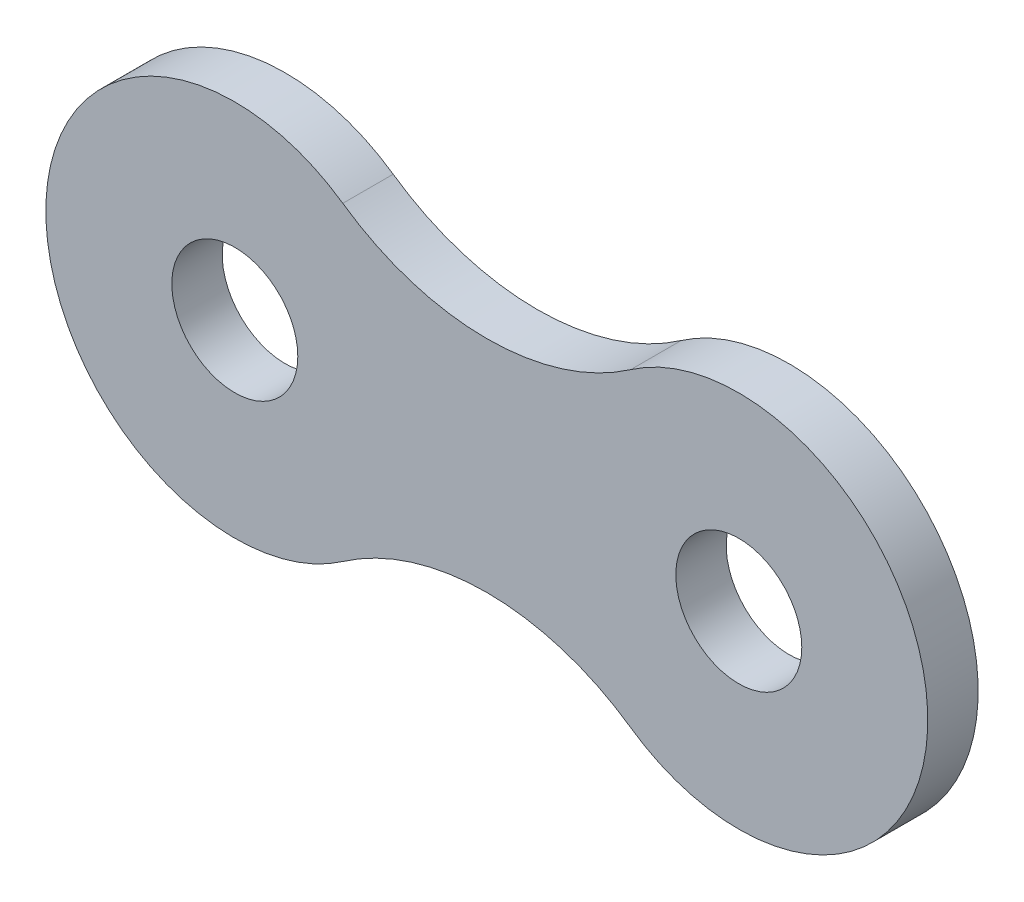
ISO-10303-21;
HEADER;
FILE_DESCRIPTION(('STEP AP214'),'2;1');
FILE_NAME('part.step','',(''),(''),'','','');
FILE_SCHEMA(('AUTOMOTIVE_DESIGN { 1 0 10303 214 1 1 1 1 }'));
ENDSEC;
DATA;
#1=APPLICATION_CONTEXT('core data for automotive mechanical design processes');
#2=APPLICATION_PROTOCOL_DEFINITION('international standard','automotive_design',2000,#1);
#3=PRODUCT_CONTEXT('',#1,'mechanical');
#4=PRODUCT('Part','Part','',(#3));
#5=PRODUCT_RELATED_PRODUCT_CATEGORY('part','',(#4));
#6=PRODUCT_DEFINITION_FORMATION('','',#4);
#7=PRODUCT_DEFINITION_CONTEXT('part definition',#1,'design');
#8=PRODUCT_DEFINITION('design','',#6,#7);
#9=PRODUCT_DEFINITION_SHAPE('','',#8);
#10=(LENGTH_UNIT() NAMED_UNIT(*) SI_UNIT(.MILLI.,.METRE.));
#11=(NAMED_UNIT(*) PLANE_ANGLE_UNIT() SI_UNIT($,.RADIAN.));
#12=(NAMED_UNIT(*) SI_UNIT($,.STERADIAN.) SOLID_ANGLE_UNIT());
#13=UNCERTAINTY_MEASURE_WITH_UNIT(LENGTH_MEASURE(1.E-05),#10,'distance_accuracy_value','');
#14=(GEOMETRIC_REPRESENTATION_CONTEXT(3) GLOBAL_UNCERTAINTY_ASSIGNED_CONTEXT((#13)) GLOBAL_UNIT_ASSIGNED_CONTEXT((#10,
#11,#12)) REPRESENTATION_CONTEXT('',''));
#15=CARTESIAN_POINT('',(0.,0.,0.));
#16=DIRECTION('',(0.,0.,1.));
#17=DIRECTION('',(1.,0.,0.));
#18=AXIS2_PLACEMENT_3D('',#15,#16,#17);
#19=CARTESIAN_POINT('',(5.,7.18070330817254,2.));
#20=DIRECTION('',(0.,0.,-1.));
#21=DIRECTION('',(-1.,0.,0.));
#22=AXIS2_PLACEMENT_3D('',#19,#20,#21);
#23=PLANE('',#22);
#24=CARTESIAN_POINT('',(0.,0.,2.));
#25=DIRECTION('',(0.,0.,1.));
#26=DIRECTION('',(1.,0.,0.));
#27=AXIS2_PLACEMENT_3D('',#24,#25,#26);
#28=CIRCLE('',#27,2.5);
#29=CARTESIAN_POINT('',(2.5,0.,2.));
#30=VERTEX_POINT('',#29);
#31=EDGE_CURVE('E100',#30,#30,#28,.T.);
#32=ORIENTED_EDGE('',*,*,#31,.F.);
#33=EDGE_LOOP('',(#32));
#34=FACE_BOUND('',#33,.T.);
#35=CARTESIAN_POINT('',(10.,14.3614066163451,2.));
#36=DIRECTION('',(0.,0.,-1.));
#37=DIRECTION('',(-1.,0.,0.));
#38=AXIS2_PLACEMENT_3D('',#35,#36,#37);
#39=CIRCLE('',#38,10.);
#40=CARTESIAN_POINT('',(15.7142857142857,6.15488854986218,2.));
#41=VERTEX_POINT('',#40);
#42=CARTESIAN_POINT('',(4.28571428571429,6.15488854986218,2.));
#43=VERTEX_POINT('',#42);
#44=EDGE_CURVE('E85',#41,#43,#39,.T.);
#45=ORIENTED_EDGE('',*,*,#44,.T.);
#46=CARTESIAN_POINT('',(0.,0.,2.));
#47=DIRECTION('',(0.,0.,1.));
#48=DIRECTION('',(1.,0.,0.));
#49=AXIS2_PLACEMENT_3D('',#46,#47,#48);
#50=CIRCLE('',#49,7.5);
#51=CARTESIAN_POINT('',(4.28571428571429,-6.15488854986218,2.));
#52=VERTEX_POINT('',#51);
#53=EDGE_CURVE('E80',#43,#52,#50,.T.);
#54=ORIENTED_EDGE('',*,*,#53,.T.);
#55=CARTESIAN_POINT('',(10.,-14.3614066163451,2.));
#56=DIRECTION('',(0.,0.,-1.));
#57=DIRECTION('',(1.,0.,0.));
#58=AXIS2_PLACEMENT_3D('',#55,#56,#57);
#59=CIRCLE('',#58,10.);
#60=CARTESIAN_POINT('',(15.7142857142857,-6.15488854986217,2.));
#61=VERTEX_POINT('',#60);
#62=EDGE_CURVE('E83',#52,#61,#59,.T.);
#63=ORIENTED_EDGE('',*,*,#62,.T.);
#64=CARTESIAN_POINT('',(20.,0.,2.));
#65=DIRECTION('',(0.,0.,1.));
#66=DIRECTION('',(1.,0.,0.));
#67=AXIS2_PLACEMENT_3D('',#64,#65,#66);
#68=CIRCLE('',#67,7.5);
#69=EDGE_CURVE('E50',#61,#41,#68,.T.);
#70=ORIENTED_EDGE('',*,*,#69,.T.);
#71=EDGE_LOOP('',(#45,#54,#63,#70));
#72=FACE_BOUND('',#71,.T.);
#73=CARTESIAN_POINT('',(20.,0.,2.));
#74=DIRECTION('',(0.,0.,1.));
#75=DIRECTION('',(1.,0.,0.));
#76=AXIS2_PLACEMENT_3D('',#73,#74,#75);
#77=CIRCLE('',#76,2.5);
#78=CARTESIAN_POINT('',(22.5,0.,2.));
#79=VERTEX_POINT('',#78);
#80=EDGE_CURVE('E115',#79,#79,#77,.T.);
#81=ORIENTED_EDGE('',*,*,#80,.F.);
#82=EDGE_LOOP('',(#81));
#83=FACE_BOUND('',#82,.T.);
#84=ADVANCED_FACE('F33',(#34,#72,#83),#23,.F.);
#85=CARTESIAN_POINT('',(5.,7.18070330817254,0.));
#86=DIRECTION('',(0.,0.,-1.));
#87=DIRECTION('',(-1.,0.,0.));
#88=AXIS2_PLACEMENT_3D('',#85,#86,#87);
#89=PLANE('',#88);
#90=CARTESIAN_POINT('',(0.,0.,0.));
#91=DIRECTION('',(0.,0.,1.));
#92=DIRECTION('',(1.,0.,0.));
#93=AXIS2_PLACEMENT_3D('',#90,#91,#92);
#94=CIRCLE('',#93,2.5);
#95=CARTESIAN_POINT('',(2.5,0.,0.));
#96=VERTEX_POINT('',#95);
#97=EDGE_CURVE('E112',#96,#96,#94,.T.);
#98=ORIENTED_EDGE('',*,*,#97,.T.);
#99=EDGE_LOOP('',(#98));
#100=FACE_BOUND('',#99,.T.);
#101=CARTESIAN_POINT('',(10.,14.3614066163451,0.));
#102=DIRECTION('',(0.,0.,-1.));
#103=DIRECTION('',(-1.,0.,0.));
#104=AXIS2_PLACEMENT_3D('',#101,#102,#103);
#105=CIRCLE('',#104,10.);
#106=CARTESIAN_POINT('',(15.7142857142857,6.15488854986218,0.));
#107=VERTEX_POINT('',#106);
#108=CARTESIAN_POINT('',(4.28571428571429,6.15488854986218,0.));
#109=VERTEX_POINT('',#108);
#110=EDGE_CURVE('E97',#107,#109,#105,.T.);
#111=ORIENTED_EDGE('',*,*,#110,.F.);
#112=CARTESIAN_POINT('',(20.,0.,0.));
#113=DIRECTION('',(0.,0.,1.));
#114=DIRECTION('',(1.,0.,0.));
#115=AXIS2_PLACEMENT_3D('',#112,#113,#114);
#116=CIRCLE('',#115,7.5);
#117=CARTESIAN_POINT('',(15.7142857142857,-6.15488854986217,0.));
#118=VERTEX_POINT('',#117);
#119=EDGE_CURVE('E73',#118,#107,#116,.T.);
#120=ORIENTED_EDGE('',*,*,#119,.F.);
#121=CARTESIAN_POINT('',(10.,-14.3614066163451,0.));
#122=DIRECTION('',(0.,0.,-1.));
#123=DIRECTION('',(1.,0.,0.));
#124=AXIS2_PLACEMENT_3D('',#121,#122,#123);
#125=CIRCLE('',#124,10.);
#126=CARTESIAN_POINT('',(4.28571428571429,-6.15488854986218,0.));
#127=VERTEX_POINT('',#126);
#128=EDGE_CURVE('E67',#127,#118,#125,.T.);
#129=ORIENTED_EDGE('',*,*,#128,.F.);
#130=CARTESIAN_POINT('',(0.,0.,0.));
#131=DIRECTION('',(0.,0.,1.));
#132=DIRECTION('',(1.,0.,0.));
#133=AXIS2_PLACEMENT_3D('',#130,#131,#132);
#134=CIRCLE('',#133,7.5);
#135=EDGE_CURVE('E89',#109,#127,#134,.T.);
#136=ORIENTED_EDGE('',*,*,#135,.F.);
#137=EDGE_LOOP('',(#111,#120,#129,#136));
#138=FACE_BOUND('',#137,.T.);
#139=CARTESIAN_POINT('',(20.,0.,0.));
#140=DIRECTION('',(0.,0.,1.));
#141=DIRECTION('',(1.,0.,0.));
#142=AXIS2_PLACEMENT_3D('',#139,#140,#141);
#143=CIRCLE('',#142,2.5);
#144=CARTESIAN_POINT('',(22.5,0.,0.));
#145=VERTEX_POINT('',#144);
#146=EDGE_CURVE('E118',#145,#145,#143,.T.);
#147=ORIENTED_EDGE('',*,*,#146,.T.);
#148=EDGE_LOOP('',(#147));
#149=FACE_BOUND('',#148,.T.);
#150=ADVANCED_FACE('F108',(#100,#138,#149),#89,.T.);
#151=CARTESIAN_POINT('',(10.,14.3614066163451,2.));
#152=DIRECTION('',(0.,0.,-1.));
#153=DIRECTION('',(-1.,0.,0.));
#154=AXIS2_PLACEMENT_3D('',#151,#152,#153);
#155=CYLINDRICAL_SURFACE('',#154,10.);
#156=ORIENTED_EDGE('',*,*,#110,.T.);
#157=DIRECTION('',(0.,0.,-1.));
#158=VECTOR('',#157,1.);
#159=CARTESIAN_POINT('',(4.28571428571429,6.15488854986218,2.));
#160=LINE('',#159,#158);
#161=EDGE_CURVE('E11',#43,#109,#160,.T.);
#162=ORIENTED_EDGE('',*,*,#161,.F.);
#163=ORIENTED_EDGE('',*,*,#44,.F.);
#164=DIRECTION('',(0.,0.,-1.));
#165=VECTOR('',#164,1.);
#166=CARTESIAN_POINT('',(15.7142857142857,6.15488854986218,2.));
#167=LINE('',#166,#165);
#168=EDGE_CURVE('E93',#41,#107,#167,.T.);
#169=ORIENTED_EDGE('',*,*,#168,.T.);
#170=EDGE_LOOP('',(#156,#162,#163,#169));
#171=FACE_BOUND('',#170,.T.);
#172=ADVANCED_FACE('F35',(#171),#155,.F.);
#173=CARTESIAN_POINT('',(0.,0.,2.));
#174=DIRECTION('',(0.,0.,-1.));
#175=DIRECTION('',(-1.,0.,0.));
#176=AXIS2_PLACEMENT_3D('',#173,#174,#175);
#177=CYLINDRICAL_SURFACE('',#176,7.5);
#178=ORIENTED_EDGE('',*,*,#135,.T.);
#179=DIRECTION('',(0.,0.,-1.));
#180=VECTOR('',#179,1.);
#181=CARTESIAN_POINT('',(4.28571428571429,-6.15488854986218,2.));
#182=LINE('',#181,#180);
#183=EDGE_CURVE('E42',#52,#127,#182,.T.);
#184=ORIENTED_EDGE('',*,*,#183,.F.);
#185=ORIENTED_EDGE('',*,*,#53,.F.);
#186=ORIENTED_EDGE('',*,*,#161,.T.);
#187=EDGE_LOOP('',(#178,#184,#185,#186));
#188=FACE_BOUND('',#187,.T.);
#189=ADVANCED_FACE('F88',(#188),#177,.T.);
#190=CARTESIAN_POINT('',(10.,-14.3614066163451,2.));
#191=DIRECTION('',(0.,0.,-1.));
#192=DIRECTION('',(-1.,0.,0.));
#193=AXIS2_PLACEMENT_3D('',#190,#191,#192);
#194=CYLINDRICAL_SURFACE('',#193,10.);
#195=ORIENTED_EDGE('',*,*,#128,.T.);
#196=DIRECTION('',(0.,0.,-1.));
#197=VECTOR('',#196,1.);
#198=CARTESIAN_POINT('',(15.7142857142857,-6.15488854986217,2.));
#199=LINE('',#198,#197);
#200=EDGE_CURVE('E90',#61,#118,#199,.T.);
#201=ORIENTED_EDGE('',*,*,#200,.F.);
#202=ORIENTED_EDGE('',*,*,#62,.F.);
#203=ORIENTED_EDGE('',*,*,#183,.T.);
#204=EDGE_LOOP('',(#195,#201,#202,#203));
#205=FACE_BOUND('',#204,.T.);
#206=ADVANCED_FACE('F91',(#205),#194,.F.);
#207=CARTESIAN_POINT('',(20.,0.,2.));
#208=DIRECTION('',(0.,0.,-1.));
#209=DIRECTION('',(-1.,0.,0.));
#210=AXIS2_PLACEMENT_3D('',#207,#208,#209);
#211=CYLINDRICAL_SURFACE('',#210,7.5);
#212=ORIENTED_EDGE('',*,*,#119,.T.);
#213=ORIENTED_EDGE('',*,*,#168,.F.);
#214=ORIENTED_EDGE('',*,*,#69,.F.);
#215=ORIENTED_EDGE('',*,*,#200,.T.);
#216=EDGE_LOOP('',(#212,#213,#214,#215));
#217=FACE_BOUND('',#216,.T.);
#218=ADVANCED_FACE('F105',(#217),#211,.T.);
#219=CARTESIAN_POINT('',(0.,0.,2.));
#220=DIRECTION('',(0.,0.,-1.));
#221=DIRECTION('',(-1.,0.,0.));
#222=AXIS2_PLACEMENT_3D('',#219,#220,#221);
#223=CYLINDRICAL_SURFACE('',#222,2.5);
#224=ORIENTED_EDGE('',*,*,#31,.T.);
#225=EDGE_LOOP('',(#224));
#226=FACE_BOUND('',#225,.T.);
#227=ORIENTED_EDGE('',*,*,#97,.F.);
#228=EDGE_LOOP('',(#227));
#229=FACE_BOUND('',#228,.T.);
#230=ADVANCED_FACE('F136',(#226,#229),#223,.F.);
#231=CARTESIAN_POINT('',(20.,0.,2.));
#232=DIRECTION('',(0.,0.,-1.));
#233=DIRECTION('',(-1.,0.,0.));
#234=AXIS2_PLACEMENT_3D('',#231,#232,#233);
#235=CYLINDRICAL_SURFACE('',#234,2.5);
#236=ORIENTED_EDGE('',*,*,#80,.T.);
#237=EDGE_LOOP('',(#236));
#238=FACE_BOUND('',#237,.T.);
#239=ORIENTED_EDGE('',*,*,#146,.F.);
#240=EDGE_LOOP('',(#239));
#241=FACE_BOUND('',#240,.T.);
#242=ADVANCED_FACE('F124',(#238,#241),#235,.F.);
#243=CLOSED_SHELL('',(#84,#150,#172,#189,#206,#218,#230,#242));
#244=MANIFOLD_SOLID_BREP('B2',#243);
#245=ADVANCED_BREP_SHAPE_REPRESENTATION('',(#18,#244),#14);
#246=SHAPE_DEFINITION_REPRESENTATION(#9,#245);
ENDSEC;
END-ISO-10303-21;
